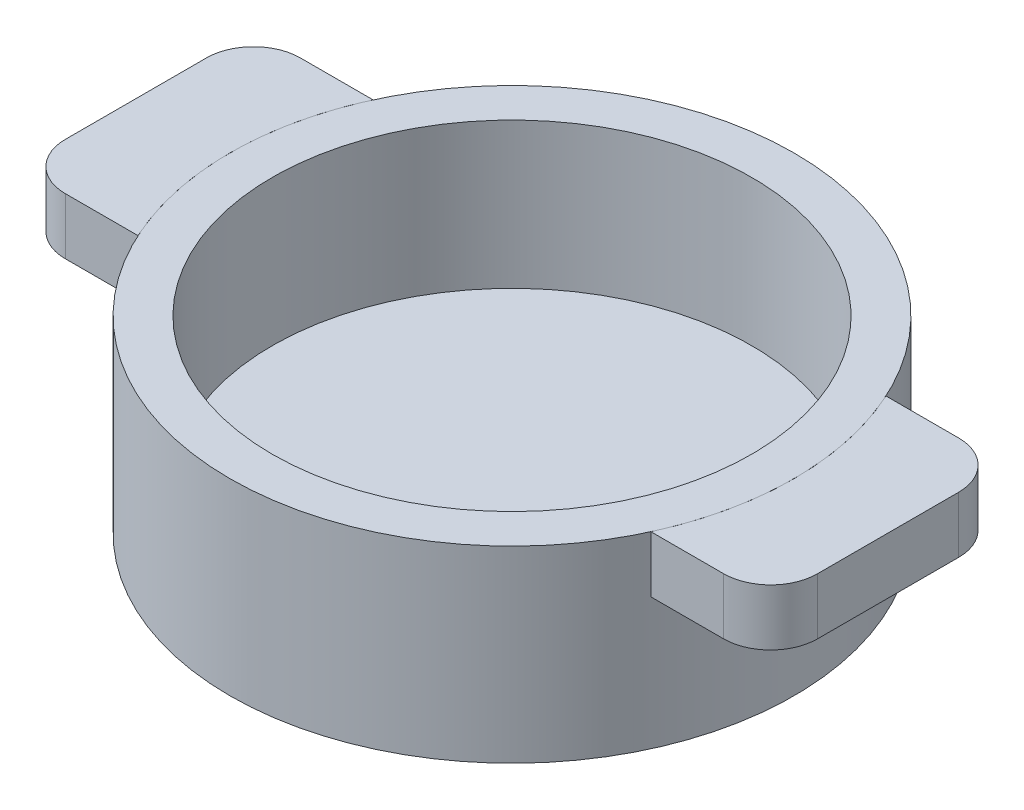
ISO-10303-21;
HEADER;
FILE_DESCRIPTION(('STEP AP214'),'2;1');
FILE_NAME('part.step','',(''),(''),'','','');
FILE_SCHEMA(('AUTOMOTIVE_DESIGN { 1 0 10303 214 1 1 1 1 }'));
ENDSEC;
DATA;
#1=APPLICATION_CONTEXT('core data for automotive mechanical design processes');
#2=APPLICATION_PROTOCOL_DEFINITION('international standard','automotive_design',2000,#1);
#3=PRODUCT_CONTEXT('',#1,'mechanical');
#4=PRODUCT('Part','Part','',(#3));
#5=PRODUCT_RELATED_PRODUCT_CATEGORY('part','',(#4));
#6=PRODUCT_DEFINITION_FORMATION('','',#4);
#7=PRODUCT_DEFINITION_CONTEXT('part definition',#1,'design');
#8=PRODUCT_DEFINITION('design','',#6,#7);
#9=PRODUCT_DEFINITION_SHAPE('','',#8);
#10=(LENGTH_UNIT() NAMED_UNIT(*) SI_UNIT(.MILLI.,.METRE.));
#11=(NAMED_UNIT(*) PLANE_ANGLE_UNIT() SI_UNIT($,.RADIAN.));
#12=(NAMED_UNIT(*) SI_UNIT($,.STERADIAN.) SOLID_ANGLE_UNIT());
#13=UNCERTAINTY_MEASURE_WITH_UNIT(LENGTH_MEASURE(1.E-05),#10,'distance_accuracy_value','');
#14=(GEOMETRIC_REPRESENTATION_CONTEXT(3) GLOBAL_UNCERTAINTY_ASSIGNED_CONTEXT((#13)) GLOBAL_UNIT_ASSIGNED_CONTEXT((#10,
#11,#12)) REPRESENTATION_CONTEXT('',''));
#15=CARTESIAN_POINT('',(0.,0.,0.));
#16=DIRECTION('',(0.,0.,1.));
#17=DIRECTION('',(1.,0.,0.));
#18=AXIS2_PLACEMENT_3D('',#15,#16,#17);
#19=CARTESIAN_POINT('',(0.,28.,0.));
#20=DIRECTION('',(0.,1.,0.));
#21=DIRECTION('',(0.,0.,1.));
#22=AXIS2_PLACEMENT_3D('',#19,#20,#21);
#23=CYLINDRICAL_SURFACE('',#22,60.);
#24=CARTESIAN_POINT('',(0.,40.,0.));
#25=DIRECTION('',(0.,-1.,0.));
#26=DIRECTION('',(0.,0.,1.));
#27=AXIS2_PLACEMENT_3D('',#24,#25,#26);
#28=CIRCLE('',#27,60.);
#29=CARTESIAN_POINT('',(-54.5435605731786,40.,25.));
#30=VERTEX_POINT('',#29);
#31=CARTESIAN_POINT('',(-54.5435605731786,40.,-24.9999999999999));
#32=VERTEX_POINT('',#31);
#33=EDGE_CURVE('E137',#30,#32,#28,.T.);
#34=ORIENTED_EDGE('',*,*,#33,.F.);
#35=DIRECTION('',(0.,1.,0.));
#36=VECTOR('',#35,1.);
#37=CARTESIAN_POINT('',(-54.5435605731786,28.,25.));
#38=LINE('',#37,#36);
#39=CARTESIAN_POINT('',(-54.5435605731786,28.,25.));
#40=VERTEX_POINT('',#39);
#41=EDGE_CURVE('E12',#40,#30,#38,.T.);
#42=ORIENTED_EDGE('',*,*,#41,.F.);
#43=CARTESIAN_POINT('',(0.,28.,0.));
#44=DIRECTION('',(0.,-1.,0.));
#45=DIRECTION('',(0.,0.,1.));
#46=AXIS2_PLACEMENT_3D('',#43,#44,#45);
#47=CIRCLE('',#46,60.);
#48=CARTESIAN_POINT('',(-54.5435605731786,28.,-24.9999999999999));
#49=VERTEX_POINT('',#48);
#50=EDGE_CURVE('E151',#40,#49,#47,.T.);
#51=ORIENTED_EDGE('',*,*,#50,.T.);
#52=DIRECTION('',(0.,1.,0.));
#53=VECTOR('',#52,1.);
#54=CARTESIAN_POINT('',(-54.5435605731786,28.,-24.9999999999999));
#55=LINE('',#54,#53);
#56=EDGE_CURVE('E55',#49,#32,#55,.T.);
#57=ORIENTED_EDGE('',*,*,#56,.T.);
#58=EDGE_LOOP('',(#34,#42,#51,#57));
#59=FACE_BOUND('',#58,.T.);
#60=ADVANCED_FACE('F52',(#59),#23,.F.);
#61=CARTESIAN_POINT('',(-69.9999999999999,28.,25.));
#62=DIRECTION('',(0.,0.,1.));
#63=DIRECTION('',(1.,0.,0.));
#64=AXIS2_PLACEMENT_3D('',#61,#62,#63);
#65=PLANE('',#64);
#66=DIRECTION('',(1.,0.,0.));
#67=VECTOR('',#66,1.);
#68=CARTESIAN_POINT('',(-69.9999999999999,40.,25.));
#69=LINE('',#68,#67);
#70=CARTESIAN_POINT('',(-69.9999999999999,40.,25.));
#71=VERTEX_POINT('',#70);
#72=EDGE_CURVE('E149',#71,#30,#69,.T.);
#73=ORIENTED_EDGE('',*,*,#72,.F.);
#74=DIRECTION('',(0.,1.,0.));
#75=VECTOR('',#74,1.);
#76=CARTESIAN_POINT('',(-69.9999999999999,28.,25.));
#77=LINE('',#76,#75);
#78=CARTESIAN_POINT('',(-69.9999999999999,28.,25.));
#79=VERTEX_POINT('',#78);
#80=EDGE_CURVE('E61',#79,#71,#77,.T.);
#81=ORIENTED_EDGE('',*,*,#80,.F.);
#82=DIRECTION('',(1.,0.,0.));
#83=VECTOR('',#82,1.);
#84=CARTESIAN_POINT('',(-69.9999999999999,28.,25.));
#85=LINE('',#84,#83);
#86=EDGE_CURVE('E127',#79,#40,#85,.T.);
#87=ORIENTED_EDGE('',*,*,#86,.T.);
#88=ORIENTED_EDGE('',*,*,#41,.T.);
#89=EDGE_LOOP('',(#73,#81,#87,#88));
#90=FACE_BOUND('',#89,.T.);
#91=ADVANCED_FACE('F159',(#90),#65,.T.);
#92=CARTESIAN_POINT('',(-70.,28.,15.));
#93=DIRECTION('',(0.,1.,0.));
#94=DIRECTION('',(0.,0.,1.));
#95=AXIS2_PLACEMENT_3D('',#92,#93,#94);
#96=CYLINDRICAL_SURFACE('',#95,10.);
#97=CARTESIAN_POINT('',(-70.,40.,15.));
#98=DIRECTION('',(0.,1.,0.));
#99=DIRECTION('',(0.,0.,-1.));
#100=AXIS2_PLACEMENT_3D('',#97,#98,#99);
#101=CIRCLE('',#100,10.);
#102=CARTESIAN_POINT('',(-80.,40.,14.9999999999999));
#103=VERTEX_POINT('',#102);
#104=EDGE_CURVE('E114',#103,#71,#101,.T.);
#105=ORIENTED_EDGE('',*,*,#104,.F.);
#106=DIRECTION('',(0.,1.,0.));
#107=VECTOR('',#106,1.);
#108=CARTESIAN_POINT('',(-80.,28.,14.9999999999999));
#109=LINE('',#108,#107);
#110=CARTESIAN_POINT('',(-80.,28.,14.9999999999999));
#111=VERTEX_POINT('',#110);
#112=EDGE_CURVE('E109',#111,#103,#109,.T.);
#113=ORIENTED_EDGE('',*,*,#112,.F.);
#114=CARTESIAN_POINT('',(-70.,28.,15.));
#115=DIRECTION('',(0.,1.,0.));
#116=DIRECTION('',(0.,0.,-1.));
#117=AXIS2_PLACEMENT_3D('',#114,#115,#116);
#118=CIRCLE('',#117,10.);
#119=EDGE_CURVE('E112',#111,#79,#118,.T.);
#120=ORIENTED_EDGE('',*,*,#119,.T.);
#121=ORIENTED_EDGE('',*,*,#80,.T.);
#122=EDGE_LOOP('',(#105,#113,#120,#121));
#123=FACE_BOUND('',#122,.T.);
#124=ADVANCED_FACE('F111',(#123),#96,.T.);
#125=CARTESIAN_POINT('',(-80.,28.,-14.9999999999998));
#126=DIRECTION('',(-1.,0.,0.));
#127=DIRECTION('',(0.,0.,1.));
#128=AXIS2_PLACEMENT_3D('',#125,#126,#127);
#129=PLANE('',#128);
#130=DIRECTION('',(0.,0.,1.));
#131=VECTOR('',#130,1.);
#132=CARTESIAN_POINT('',(-80.,40.,-14.9999999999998));
#133=LINE('',#132,#131);
#134=CARTESIAN_POINT('',(-80.,40.,-14.9999999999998));
#135=VERTEX_POINT('',#134);
#136=EDGE_CURVE('E146',#135,#103,#133,.T.);
#137=ORIENTED_EDGE('',*,*,#136,.F.);
#138=DIRECTION('',(0.,1.,0.));
#139=VECTOR('',#138,1.);
#140=CARTESIAN_POINT('',(-80.,28.,-14.9999999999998));
#141=LINE('',#140,#139);
#142=CARTESIAN_POINT('',(-80.,28.,-14.9999999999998));
#143=VERTEX_POINT('',#142);
#144=EDGE_CURVE('E119',#143,#135,#141,.T.);
#145=ORIENTED_EDGE('',*,*,#144,.F.);
#146=DIRECTION('',(0.,0.,1.));
#147=VECTOR('',#146,1.);
#148=CARTESIAN_POINT('',(-80.,28.,-14.9999999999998));
#149=LINE('',#148,#147);
#150=EDGE_CURVE('E125',#143,#111,#149,.T.);
#151=ORIENTED_EDGE('',*,*,#150,.T.);
#152=ORIENTED_EDGE('',*,*,#112,.T.);
#153=EDGE_LOOP('',(#137,#145,#151,#152));
#154=FACE_BOUND('',#153,.T.);
#155=ADVANCED_FACE('F129',(#154),#129,.T.);
#156=CARTESIAN_POINT('',(-70.,28.,-14.9999999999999));
#157=DIRECTION('',(0.,1.,0.));
#158=DIRECTION('',(0.,0.,1.));
#159=AXIS2_PLACEMENT_3D('',#156,#157,#158);
#160=CYLINDRICAL_SURFACE('',#159,10.);
#161=CARTESIAN_POINT('',(-70.,40.,-14.9999999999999));
#162=DIRECTION('',(0.,1.,0.));
#163=DIRECTION('',(0.,0.,-1.));
#164=AXIS2_PLACEMENT_3D('',#161,#162,#163);
#165=CIRCLE('',#164,10.);
#166=CARTESIAN_POINT('',(-70.,40.,-24.9999999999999));
#167=VERTEX_POINT('',#166);
#168=EDGE_CURVE('E143',#167,#135,#165,.T.);
#169=ORIENTED_EDGE('',*,*,#168,.F.);
#170=DIRECTION('',(0.,1.,0.));
#171=VECTOR('',#170,1.);
#172=CARTESIAN_POINT('',(-70.,28.,-24.9999999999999));
#173=LINE('',#172,#171);
#174=CARTESIAN_POINT('',(-70.,28.,-24.9999999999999));
#175=VERTEX_POINT('',#174);
#176=EDGE_CURVE('E154',#175,#167,#173,.T.);
#177=ORIENTED_EDGE('',*,*,#176,.F.);
#178=CARTESIAN_POINT('',(-70.,28.,-14.9999999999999));
#179=DIRECTION('',(0.,1.,0.));
#180=DIRECTION('',(0.,0.,-1.));
#181=AXIS2_PLACEMENT_3D('',#178,#179,#180);
#182=CIRCLE('',#181,10.);
#183=EDGE_CURVE('E130',#175,#143,#182,.T.);
#184=ORIENTED_EDGE('',*,*,#183,.T.);
#185=ORIENTED_EDGE('',*,*,#144,.T.);
#186=EDGE_LOOP('',(#169,#177,#184,#185));
#187=FACE_BOUND('',#186,.T.);
#188=ADVANCED_FACE('F172',(#187),#160,.T.);
#189=CARTESIAN_POINT('',(-70.,28.,-24.9999999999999));
#190=DIRECTION('',(0.,0.,-1.));
#191=DIRECTION('',(-1.,0.,0.));
#192=AXIS2_PLACEMENT_3D('',#189,#190,#191);
#193=PLANE('',#192);
#194=DIRECTION('',(-1.,0.,0.));
#195=VECTOR('',#194,1.);
#196=CARTESIAN_POINT('',(-70.,40.,-24.9999999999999));
#197=LINE('',#196,#195);
#198=EDGE_CURVE('E140',#32,#167,#197,.T.);
#199=ORIENTED_EDGE('',*,*,#198,.F.);
#200=ORIENTED_EDGE('',*,*,#56,.F.);
#201=DIRECTION('',(-1.,0.,0.));
#202=VECTOR('',#201,1.);
#203=CARTESIAN_POINT('',(-70.,28.,-24.9999999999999));
#204=LINE('',#203,#202);
#205=EDGE_CURVE('E132',#49,#175,#204,.T.);
#206=ORIENTED_EDGE('',*,*,#205,.T.);
#207=ORIENTED_EDGE('',*,*,#176,.T.);
#208=EDGE_LOOP('',(#199,#200,#206,#207));
#209=FACE_BOUND('',#208,.T.);
#210=ADVANCED_FACE('F156',(#209),#193,.T.);
#211=CARTESIAN_POINT('',(0.,28.,0.));
#212=DIRECTION('',(0.,1.,0.));
#213=DIRECTION('',(0.,0.,1.));
#214=AXIS2_PLACEMENT_3D('',#211,#212,#213);
#215=PLANE('',#214);
#216=ORIENTED_EDGE('',*,*,#50,.F.);
#217=ORIENTED_EDGE('',*,*,#86,.F.);
#218=ORIENTED_EDGE('',*,*,#119,.F.);
#219=ORIENTED_EDGE('',*,*,#150,.F.);
#220=ORIENTED_EDGE('',*,*,#183,.F.);
#221=ORIENTED_EDGE('',*,*,#205,.F.);
#222=EDGE_LOOP('',(#216,#217,#218,#219,#220,#221));
#223=FACE_BOUND('',#222,.T.);
#224=ADVANCED_FACE('F123',(#223),#215,.F.);
#225=CARTESIAN_POINT('',(0.,40.,0.));
#226=DIRECTION('',(0.,1.,0.));
#227=DIRECTION('',(0.,0.,1.));
#228=AXIS2_PLACEMENT_3D('',#225,#226,#227);
#229=PLANE('',#228);
#230=ORIENTED_EDGE('',*,*,#33,.T.);
#231=ORIENTED_EDGE('',*,*,#198,.T.);
#232=ORIENTED_EDGE('',*,*,#168,.T.);
#233=ORIENTED_EDGE('',*,*,#136,.T.);
#234=ORIENTED_EDGE('',*,*,#104,.T.);
#235=ORIENTED_EDGE('',*,*,#72,.T.);
#236=EDGE_LOOP('',(#230,#231,#232,#233,#234,#235));
#237=FACE_BOUND('',#236,.T.);
#238=ADVANCED_FACE('F158',(#237),#229,.T.);
#239=CLOSED_SHELL('',(#60,#91,#124,#155,#188,#210,#224,#238));
#240=MANIFOLD_SOLID_BREP('B2',#239);
#241=CARTESIAN_POINT('',(70.,28.,15.));
#242=DIRECTION('',(0.,1.,0.));
#243=DIRECTION('',(0.,0.,1.));
#244=AXIS2_PLACEMENT_3D('',#241,#242,#243);
#245=CYLINDRICAL_SURFACE('',#244,10.);
#246=CARTESIAN_POINT('',(70.,40.,15.));
#247=DIRECTION('',(0.,1.,0.));
#248=DIRECTION('',(0.,0.,1.));
#249=AXIS2_PLACEMENT_3D('',#246,#247,#248);
#250=CIRCLE('',#249,10.);
#251=CARTESIAN_POINT('',(69.9999999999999,40.,25.));
#252=VERTEX_POINT('',#251);
#253=CARTESIAN_POINT('',(80.,40.,14.9999999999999));
#254=VERTEX_POINT('',#253);
#255=EDGE_CURVE('E320',#252,#254,#250,.T.);
#256=ORIENTED_EDGE('',*,*,#255,.F.);
#257=DIRECTION('',(0.,1.,0.));
#258=VECTOR('',#257,1.);
#259=CARTESIAN_POINT('',(69.9999999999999,28.,25.));
#260=LINE('',#259,#258);
#261=CARTESIAN_POINT('',(69.9999999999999,28.,25.));
#262=VERTEX_POINT('',#261);
#263=EDGE_CURVE('E50',#262,#252,#260,.T.);
#264=ORIENTED_EDGE('',*,*,#263,.F.);
#265=CARTESIAN_POINT('',(70.,28.,15.));
#266=DIRECTION('',(0.,1.,0.));
#267=DIRECTION('',(0.,0.,1.));
#268=AXIS2_PLACEMENT_3D('',#265,#266,#267);
#269=CIRCLE('',#268,10.);
#270=CARTESIAN_POINT('',(80.,28.,14.9999999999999));
#271=VERTEX_POINT('',#270);
#272=EDGE_CURVE('E334',#262,#271,#269,.T.);
#273=ORIENTED_EDGE('',*,*,#272,.T.);
#274=DIRECTION('',(0.,1.,0.));
#275=VECTOR('',#274,1.);
#276=CARTESIAN_POINT('',(80.,28.,14.9999999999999));
#277=LINE('',#276,#275);
#278=EDGE_CURVE('E238',#271,#254,#277,.T.);
#279=ORIENTED_EDGE('',*,*,#278,.T.);
#280=EDGE_LOOP('',(#256,#264,#273,#279));
#281=FACE_BOUND('',#280,.T.);
#282=ADVANCED_FACE('F235',(#281),#245,.T.);
#283=CARTESIAN_POINT('',(54.5435605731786,28.,25.));
#284=DIRECTION('',(0.,0.,1.));
#285=DIRECTION('',(1.,0.,0.));
#286=AXIS2_PLACEMENT_3D('',#283,#284,#285);
#287=PLANE('',#286);
#288=DIRECTION('',(1.,0.,0.));
#289=VECTOR('',#288,1.);
#290=CARTESIAN_POINT('',(54.5435605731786,40.,25.));
#291=LINE('',#290,#289);
#292=CARTESIAN_POINT('',(54.5435605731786,40.,25.));
#293=VERTEX_POINT('',#292);
#294=EDGE_CURVE('E332',#293,#252,#291,.T.);
#295=ORIENTED_EDGE('',*,*,#294,.F.);
#296=DIRECTION('',(0.,1.,0.));
#297=VECTOR('',#296,1.);
#298=CARTESIAN_POINT('',(54.5435605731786,28.,25.));
#299=LINE('',#298,#297);
#300=CARTESIAN_POINT('',(54.5435605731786,28.,25.));
#301=VERTEX_POINT('',#300);
#302=EDGE_CURVE('E244',#301,#293,#299,.T.);
#303=ORIENTED_EDGE('',*,*,#302,.F.);
#304=DIRECTION('',(1.,0.,0.));
#305=VECTOR('',#304,1.);
#306=CARTESIAN_POINT('',(54.5435605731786,28.,25.));
#307=LINE('',#306,#305);
#308=EDGE_CURVE('E310',#301,#262,#307,.T.);
#309=ORIENTED_EDGE('',*,*,#308,.T.);
#310=ORIENTED_EDGE('',*,*,#263,.T.);
#311=EDGE_LOOP('',(#295,#303,#309,#310));
#312=FACE_BOUND('',#311,.T.);
#313=ADVANCED_FACE('F342',(#312),#287,.T.);
#314=CARTESIAN_POINT('',(0.,28.,0.));
#315=DIRECTION('',(0.,1.,0.));
#316=DIRECTION('',(0.,0.,1.));
#317=AXIS2_PLACEMENT_3D('',#314,#315,#316);
#318=CYLINDRICAL_SURFACE('',#317,60.);
#319=CARTESIAN_POINT('',(0.,40.,0.));
#320=DIRECTION('',(0.,-1.,0.));
#321=DIRECTION('',(0.,0.,1.));
#322=AXIS2_PLACEMENT_3D('',#319,#320,#321);
#323=CIRCLE('',#322,60.);
#324=CARTESIAN_POINT('',(54.5435605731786,40.,-25.));
#325=VERTEX_POINT('',#324);
#326=EDGE_CURVE('E297',#325,#293,#323,.T.);
#327=ORIENTED_EDGE('',*,*,#326,.F.);
#328=DIRECTION('',(0.,1.,0.));
#329=VECTOR('',#328,1.);
#330=CARTESIAN_POINT('',(54.5435605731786,28.,-25.));
#331=LINE('',#330,#329);
#332=CARTESIAN_POINT('',(54.5435605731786,28.,-25.));
#333=VERTEX_POINT('',#332);
#334=EDGE_CURVE('E292',#333,#325,#331,.T.);
#335=ORIENTED_EDGE('',*,*,#334,.F.);
#336=CARTESIAN_POINT('',(0.,28.,0.));
#337=DIRECTION('',(0.,-1.,0.));
#338=DIRECTION('',(0.,0.,1.));
#339=AXIS2_PLACEMENT_3D('',#336,#337,#338);
#340=CIRCLE('',#339,60.);
#341=EDGE_CURVE('E295',#333,#301,#340,.T.);
#342=ORIENTED_EDGE('',*,*,#341,.T.);
#343=ORIENTED_EDGE('',*,*,#302,.T.);
#344=EDGE_LOOP('',(#327,#335,#342,#343));
#345=FACE_BOUND('',#344,.T.);
#346=ADVANCED_FACE('F294',(#345),#318,.F.);
#347=CARTESIAN_POINT('',(54.5435605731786,28.,-25.));
#348=DIRECTION('',(0.,0.,-1.));
#349=DIRECTION('',(-1.,0.,0.));
#350=AXIS2_PLACEMENT_3D('',#347,#348,#349);
#351=PLANE('',#350);
#352=DIRECTION('',(-1.,0.,0.));
#353=VECTOR('',#352,1.);
#354=CARTESIAN_POINT('',(54.5435605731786,40.,-25.));
#355=LINE('',#354,#353);
#356=CARTESIAN_POINT('',(69.9999999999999,40.,-25.));
#357=VERTEX_POINT('',#356);
#358=EDGE_CURVE('E329',#357,#325,#355,.T.);
#359=ORIENTED_EDGE('',*,*,#358,.F.);
#360=DIRECTION('',(0.,1.,0.));
#361=VECTOR('',#360,1.);
#362=CARTESIAN_POINT('',(69.9999999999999,28.,-25.));
#363=LINE('',#362,#361);
#364=CARTESIAN_POINT('',(69.9999999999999,28.,-25.));
#365=VERTEX_POINT('',#364);
#366=EDGE_CURVE('E302',#365,#357,#363,.T.);
#367=ORIENTED_EDGE('',*,*,#366,.F.);
#368=DIRECTION('',(-1.,0.,0.));
#369=VECTOR('',#368,1.);
#370=CARTESIAN_POINT('',(54.5435605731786,28.,-25.));
#371=LINE('',#370,#369);
#372=EDGE_CURVE('E308',#365,#333,#371,.T.);
#373=ORIENTED_EDGE('',*,*,#372,.T.);
#374=ORIENTED_EDGE('',*,*,#334,.T.);
#375=EDGE_LOOP('',(#359,#367,#373,#374));
#376=FACE_BOUND('',#375,.T.);
#377=ADVANCED_FACE('F312',(#376),#351,.T.);
#378=CARTESIAN_POINT('',(70.,28.,-15.));
#379=DIRECTION('',(0.,1.,0.));
#380=DIRECTION('',(0.,0.,1.));
#381=AXIS2_PLACEMENT_3D('',#378,#379,#380);
#382=CYLINDRICAL_SURFACE('',#381,9.99999999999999);
#383=CARTESIAN_POINT('',(70.,40.,-15.));
#384=DIRECTION('',(0.,1.,0.));
#385=DIRECTION('',(0.,0.,1.));
#386=AXIS2_PLACEMENT_3D('',#383,#384,#385);
#387=CIRCLE('',#386,9.99999999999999);
#388=CARTESIAN_POINT('',(80.,40.,-14.9999999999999));
#389=VERTEX_POINT('',#388);
#390=EDGE_CURVE('E326',#389,#357,#387,.T.);
#391=ORIENTED_EDGE('',*,*,#390,.F.);
#392=DIRECTION('',(0.,1.,0.));
#393=VECTOR('',#392,1.);
#394=CARTESIAN_POINT('',(80.,28.,-14.9999999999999));
#395=LINE('',#394,#393);
#396=CARTESIAN_POINT('',(80.,28.,-14.9999999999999));
#397=VERTEX_POINT('',#396);
#398=EDGE_CURVE('E337',#397,#389,#395,.T.);
#399=ORIENTED_EDGE('',*,*,#398,.F.);
#400=CARTESIAN_POINT('',(70.,28.,-15.));
#401=DIRECTION('',(0.,1.,0.));
#402=DIRECTION('',(0.,0.,1.));
#403=AXIS2_PLACEMENT_3D('',#400,#401,#402);
#404=CIRCLE('',#403,9.99999999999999);
#405=EDGE_CURVE('E313',#397,#365,#404,.T.);
#406=ORIENTED_EDGE('',*,*,#405,.T.);
#407=ORIENTED_EDGE('',*,*,#366,.T.);
#408=EDGE_LOOP('',(#391,#399,#406,#407));
#409=FACE_BOUND('',#408,.T.);
#410=ADVANCED_FACE('F355',(#409),#382,.T.);
#411=CARTESIAN_POINT('',(80.,28.,-14.9999999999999));
#412=DIRECTION('',(1.,0.,0.));
#413=DIRECTION('',(0.,0.,-1.));
#414=AXIS2_PLACEMENT_3D('',#411,#412,#413);
#415=PLANE('',#414);
#416=DIRECTION('',(0.,0.,-1.));
#417=VECTOR('',#416,1.);
#418=CARTESIAN_POINT('',(80.,40.,-14.9999999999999));
#419=LINE('',#418,#417);
#420=EDGE_CURVE('E323',#254,#389,#419,.T.);
#421=ORIENTED_EDGE('',*,*,#420,.F.);
#422=ORIENTED_EDGE('',*,*,#278,.F.);
#423=DIRECTION('',(0.,0.,-1.));
#424=VECTOR('',#423,1.);
#425=CARTESIAN_POINT('',(80.,28.,-14.9999999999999));
#426=LINE('',#425,#424);
#427=EDGE_CURVE('E315',#271,#397,#426,.T.);
#428=ORIENTED_EDGE('',*,*,#427,.T.);
#429=ORIENTED_EDGE('',*,*,#398,.T.);
#430=EDGE_LOOP('',(#421,#422,#428,#429));
#431=FACE_BOUND('',#430,.T.);
#432=ADVANCED_FACE('F339',(#431),#415,.T.);
#433=CARTESIAN_POINT('',(70.,28.,15.));
#434=DIRECTION('',(0.,1.,0.));
#435=DIRECTION('',(0.,0.,1.));
#436=AXIS2_PLACEMENT_3D('',#433,#434,#435);
#437=PLANE('',#436);
#438=ORIENTED_EDGE('',*,*,#272,.F.);
#439=ORIENTED_EDGE('',*,*,#308,.F.);
#440=ORIENTED_EDGE('',*,*,#341,.F.);
#441=ORIENTED_EDGE('',*,*,#372,.F.);
#442=ORIENTED_EDGE('',*,*,#405,.F.);
#443=ORIENTED_EDGE('',*,*,#427,.F.);
#444=EDGE_LOOP('',(#438,#439,#440,#441,#442,#443));
#445=FACE_BOUND('',#444,.T.);
#446=ADVANCED_FACE('F306',(#445),#437,.F.);
#447=CARTESIAN_POINT('',(70.,40.,15.));
#448=DIRECTION('',(0.,1.,0.));
#449=DIRECTION('',(0.,0.,1.));
#450=AXIS2_PLACEMENT_3D('',#447,#448,#449);
#451=PLANE('',#450);
#452=ORIENTED_EDGE('',*,*,#255,.T.);
#453=ORIENTED_EDGE('',*,*,#420,.T.);
#454=ORIENTED_EDGE('',*,*,#390,.T.);
#455=ORIENTED_EDGE('',*,*,#358,.T.);
#456=ORIENTED_EDGE('',*,*,#326,.T.);
#457=ORIENTED_EDGE('',*,*,#294,.T.);
#458=EDGE_LOOP('',(#452,#453,#454,#455,#456,#457));
#459=FACE_BOUND('',#458,.T.);
#460=ADVANCED_FACE('F341',(#459),#451,.T.);
#461=CLOSED_SHELL('',(#282,#313,#346,#377,#410,#432,#446,#460));
#462=MANIFOLD_SOLID_BREP('B6',#461);
#463=CARTESIAN_POINT('',(0.,40.,0.));
#464=DIRECTION('',(0.,-1.,0.));
#465=DIRECTION('',(0.,0.,-1.));
#466=AXIS2_PLACEMENT_3D('',#463,#464,#465);
#467=CYLINDRICAL_SURFACE('',#466,60.);
#468=CARTESIAN_POINT('',(0.,40.,0.));
#469=DIRECTION('',(0.,1.,0.));
#470=DIRECTION('',(0.,0.,1.));
#471=AXIS2_PLACEMENT_3D('',#468,#469,#470);
#472=CIRCLE('',#471,60.);
#473=CARTESIAN_POINT('',(0.,40.,60.));
#474=VERTEX_POINT('',#473);
#475=EDGE_CURVE('E234',#474,#474,#472,.T.);
#476=ORIENTED_EDGE('',*,*,#475,.F.);
#477=EDGE_LOOP('',(#476));
#478=FACE_BOUND('',#477,.T.);
#479=CARTESIAN_POINT('',(0.,0.,0.));
#480=DIRECTION('',(0.,1.,0.));
#481=DIRECTION('',(0.,0.,1.));
#482=AXIS2_PLACEMENT_3D('',#479,#480,#481);
#483=CIRCLE('',#482,60.);
#484=CARTESIAN_POINT('',(0.,0.,60.));
#485=VERTEX_POINT('',#484);
#486=EDGE_CURVE('E414',#485,#485,#483,.T.);
#487=ORIENTED_EDGE('',*,*,#486,.T.);
#488=EDGE_LOOP('',(#487));
#489=FACE_BOUND('',#488,.T.);
#490=ADVANCED_FACE('F411',(#478,#489),#467,.T.);
#491=CARTESIAN_POINT('',(0.,40.,0.));
#492=DIRECTION('',(0.,1.,0.));
#493=DIRECTION('',(0.,0.,1.));
#494=AXIS2_PLACEMENT_3D('',#491,#492,#493);
#495=PLANE('',#494);
#496=CARTESIAN_POINT('',(0.,40.,0.));
#497=DIRECTION('',(0.,1.,0.));
#498=DIRECTION('',(0.,0.,1.));
#499=AXIS2_PLACEMENT_3D('',#496,#497,#498);
#500=CIRCLE('',#499,51.);
#501=CARTESIAN_POINT('',(0.,40.,51.));
#502=VERTEX_POINT('',#501);
#503=EDGE_CURVE('E423',#502,#502,#500,.T.);
#504=ORIENTED_EDGE('',*,*,#503,.F.);
#505=EDGE_LOOP('',(#504));
#506=FACE_BOUND('',#505,.T.);
#507=ORIENTED_EDGE('',*,*,#475,.T.);
#508=EDGE_LOOP('',(#507));
#509=FACE_BOUND('',#508,.T.);
#510=ADVANCED_FACE('F445',(#506,#509),#495,.T.);
#511=CARTESIAN_POINT('',(0.,0.,0.));
#512=DIRECTION('',(0.,1.,0.));
#513=DIRECTION('',(0.,0.,1.));
#514=AXIS2_PLACEMENT_3D('',#511,#512,#513);
#515=PLANE('',#514);
#516=ORIENTED_EDGE('',*,*,#486,.F.);
#517=EDGE_LOOP('',(#516));
#518=FACE_BOUND('',#517,.T.);
#519=ADVANCED_FACE('F437',(#518),#515,.F.);
#520=CARTESIAN_POINT('',(0.,40.,0.));
#521=DIRECTION('',(0.,-1.,0.));
#522=DIRECTION('',(0.,0.,-1.));
#523=AXIS2_PLACEMENT_3D('',#520,#521,#522);
#524=CYLINDRICAL_SURFACE('',#523,51.);
#525=ORIENTED_EDGE('',*,*,#503,.T.);
#526=EDGE_LOOP('',(#525));
#527=FACE_BOUND('',#526,.T.);
#528=CARTESIAN_POINT('',(0.,9.,0.));
#529=DIRECTION('',(0.,1.,0.));
#530=DIRECTION('',(0.,0.,1.));
#531=AXIS2_PLACEMENT_3D('',#528,#529,#530);
#532=CIRCLE('',#531,51.);
#533=CARTESIAN_POINT('',(0.,9.,51.));
#534=VERTEX_POINT('',#533);
#535=EDGE_CURVE('E428',#534,#534,#532,.T.);
#536=ORIENTED_EDGE('',*,*,#535,.F.);
#537=EDGE_LOOP('',(#536));
#538=FACE_BOUND('',#537,.T.);
#539=ADVANCED_FACE('F435',(#527,#538),#524,.F.);
#540=CARTESIAN_POINT('',(0.,9.,0.));
#541=DIRECTION('',(0.,1.,0.));
#542=DIRECTION('',(0.,0.,1.));
#543=AXIS2_PLACEMENT_3D('',#540,#541,#542);
#544=PLANE('',#543);
#545=ORIENTED_EDGE('',*,*,#535,.T.);
#546=EDGE_LOOP('',(#545));
#547=FACE_BOUND('',#546,.T.);
#548=ADVANCED_FACE('F433',(#547),#544,.T.);
#549=CLOSED_SHELL('',(#490,#510,#519,#539,#548));
#550=MANIFOLD_SOLID_BREP('B44',#549);
#551=ADVANCED_BREP_SHAPE_REPRESENTATION('',(#18,#240,#462,#550),#14);
#552=SHAPE_DEFINITION_REPRESENTATION(#9,#551);
ENDSEC;
END-ISO-10303-21;
